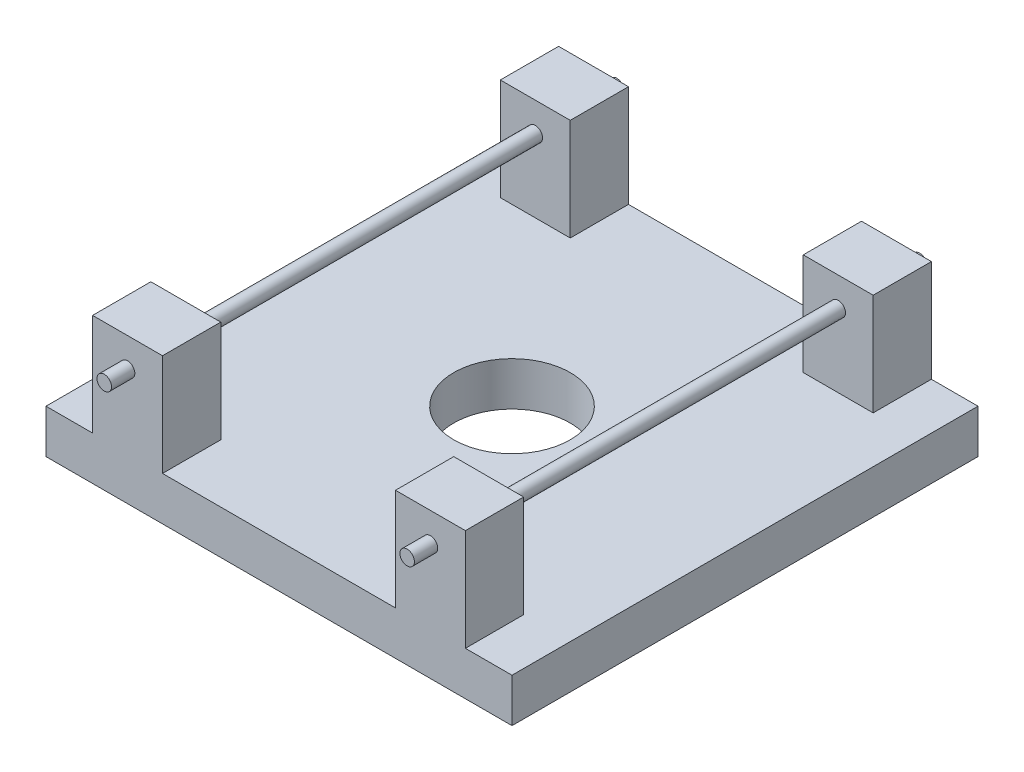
ISO-10303-21;
HEADER;
FILE_DESCRIPTION(('STEP AP214'),'2;1');
FILE_NAME('part.step','',(''),(''),'','','');
FILE_SCHEMA(('AUTOMOTIVE_DESIGN { 1 0 10303 214 1 1 1 1 }'));
ENDSEC;
DATA;
#1=APPLICATION_CONTEXT('core data for automotive mechanical design processes');
#2=APPLICATION_PROTOCOL_DEFINITION('international standard','automotive_design',2000,#1);
#3=PRODUCT_CONTEXT('',#1,'mechanical');
#4=PRODUCT('Part','Part','',(#3));
#5=PRODUCT_RELATED_PRODUCT_CATEGORY('part','',(#4));
#6=PRODUCT_DEFINITION_FORMATION('','',#4);
#7=PRODUCT_DEFINITION_CONTEXT('part definition',#1,'design');
#8=PRODUCT_DEFINITION('design','',#6,#7);
#9=PRODUCT_DEFINITION_SHAPE('','',#8);
#10=(LENGTH_UNIT() NAMED_UNIT(*) SI_UNIT(.MILLI.,.METRE.));
#11=(NAMED_UNIT(*) PLANE_ANGLE_UNIT() SI_UNIT($,.RADIAN.));
#12=(NAMED_UNIT(*) SI_UNIT($,.STERADIAN.) SOLID_ANGLE_UNIT());
#13=UNCERTAINTY_MEASURE_WITH_UNIT(LENGTH_MEASURE(1.E-05),#10,'distance_accuracy_value','');
#14=(GEOMETRIC_REPRESENTATION_CONTEXT(3) GLOBAL_UNCERTAINTY_ASSIGNED_CONTEXT((#13)) GLOBAL_UNIT_ASSIGNED_CONTEXT((#10,
#11,#12)) REPRESENTATION_CONTEXT('',''));
#15=CARTESIAN_POINT('',(0.,0.,0.));
#16=DIRECTION('',(0.,0.,1.));
#17=DIRECTION('',(1.,0.,0.));
#18=AXIS2_PLACEMENT_3D('',#15,#16,#17);
#19=CARTESIAN_POINT('',(-20.32,15.875,-25.4));
#20=DIRECTION('',(1.,0.,0.));
#21=DIRECTION('',(0.,0.,-1.));
#22=AXIS2_PLACEMENT_3D('',#19,#20,#21);
#23=PLANE('',#22);
#24=DIRECTION('',(0.,1.,0.));
#25=VECTOR('',#24,1.);
#26=CARTESIAN_POINT('',(-20.32,-34.092028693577,-19.05));
#27=LINE('',#26,#25);
#28=CARTESIAN_POINT('',(-20.32,4.7625,-19.05));
#29=VERTEX_POINT('',#28);
#30=CARTESIAN_POINT('',(-20.32,15.875,-19.05));
#31=VERTEX_POINT('',#30);
#32=EDGE_CURVE('E332',#29,#31,#27,.T.);
#33=ORIENTED_EDGE('',*,*,#32,.T.);
#34=DIRECTION('',(0.,0.,1.));
#35=VECTOR('',#34,1.);
#36=CARTESIAN_POINT('',(-20.32,15.875,-25.4));
#37=LINE('',#36,#35);
#38=CARTESIAN_POINT('',(-20.32,15.875,-25.4));
#39=VERTEX_POINT('',#38);
#40=EDGE_CURVE('E219',#39,#31,#37,.T.);
#41=ORIENTED_EDGE('',*,*,#40,.F.);
#42=DIRECTION('',(0.,-1.,0.));
#43=VECTOR('',#42,1.);
#44=CARTESIAN_POINT('',(-20.32,15.875,-25.4));
#45=LINE('',#44,#43);
#46=CARTESIAN_POINT('',(-20.32,4.7625,-25.4));
#47=VERTEX_POINT('',#46);
#48=EDGE_CURVE('E231',#39,#47,#45,.T.);
#49=ORIENTED_EDGE('',*,*,#48,.T.);
#50=DIRECTION('',(0.,0.,1.));
#51=VECTOR('',#50,1.);
#52=CARTESIAN_POINT('',(-20.32,4.7625,-25.4));
#53=LINE('',#52,#51);
#54=EDGE_CURVE('E232',#47,#29,#53,.T.);
#55=ORIENTED_EDGE('',*,*,#54,.T.);
#56=EDGE_LOOP('',(#33,#41,#49,#55));
#57=FACE_BOUND('',#56,.T.);
#58=ADVANCED_FACE('F33',(#57),#23,.F.);
#59=CARTESIAN_POINT('',(-12.7,15.875,-25.4));
#60=DIRECTION('',(-1.,0.,0.));
#61=DIRECTION('',(0.,0.,1.));
#62=AXIS2_PLACEMENT_3D('',#59,#60,#61);
#63=PLANE('',#62);
#64=DIRECTION('',(0.,1.,0.));
#65=VECTOR('',#64,1.);
#66=CARTESIAN_POINT('',(-12.7,-34.092028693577,-19.05));
#67=LINE('',#66,#65);
#68=CARTESIAN_POINT('',(-12.7,4.7625,-19.05));
#69=VERTEX_POINT('',#68);
#70=CARTESIAN_POINT('',(-12.7,15.875,-19.05));
#71=VERTEX_POINT('',#70);
#72=EDGE_CURVE('E330',#69,#71,#67,.T.);
#73=ORIENTED_EDGE('',*,*,#72,.F.);
#74=DIRECTION('',(0.,0.,-1.));
#75=VECTOR('',#74,1.);
#76=CARTESIAN_POINT('',(-12.7,4.7625,-25.4));
#77=LINE('',#76,#75);
#78=CARTESIAN_POINT('',(-12.7,4.7625,-25.4));
#79=VERTEX_POINT('',#78);
#80=EDGE_CURVE('E235',#69,#79,#77,.T.);
#81=ORIENTED_EDGE('',*,*,#80,.T.);
#82=DIRECTION('',(0.,-1.,0.));
#83=VECTOR('',#82,1.);
#84=CARTESIAN_POINT('',(-12.7,15.875,-25.4));
#85=LINE('',#84,#83);
#86=CARTESIAN_POINT('',(-12.7,15.875,-25.4));
#87=VERTEX_POINT('',#86);
#88=EDGE_CURVE('E241',#87,#79,#85,.T.);
#89=ORIENTED_EDGE('',*,*,#88,.F.);
#90=DIRECTION('',(0.,0.,-1.));
#91=VECTOR('',#90,1.);
#92=CARTESIAN_POINT('',(-12.7,15.875,-25.4));
#93=LINE('',#92,#91);
#94=EDGE_CURVE('E225',#71,#87,#93,.T.);
#95=ORIENTED_EDGE('',*,*,#94,.F.);
#96=EDGE_LOOP('',(#73,#81,#89,#95));
#97=FACE_BOUND('',#96,.T.);
#98=ADVANCED_FACE('F385',(#97),#63,.F.);
#99=CARTESIAN_POINT('',(0.,15.875,0.));
#100=DIRECTION('',(0.,1.,0.));
#101=DIRECTION('',(0.,0.,1.));
#102=AXIS2_PLACEMENT_3D('',#99,#100,#101);
#103=PLANE('',#102);
#104=ORIENTED_EDGE('',*,*,#40,.T.);
#105=DIRECTION('',(1.,0.,0.));
#106=VECTOR('',#105,1.);
#107=CARTESIAN_POINT('',(-20.32,15.875,-19.05));
#108=LINE('',#107,#106);
#109=EDGE_CURVE('E329',#31,#71,#108,.T.);
#110=ORIENTED_EDGE('',*,*,#109,.T.);
#111=ORIENTED_EDGE('',*,*,#94,.T.);
#112=DIRECTION('',(-1.,0.,0.));
#113=VECTOR('',#112,1.);
#114=CARTESIAN_POINT('',(-20.32,15.875,-25.4));
#115=LINE('',#114,#113);
#116=EDGE_CURVE('E229',#87,#39,#115,.T.);
#117=ORIENTED_EDGE('',*,*,#116,.T.);
#118=EDGE_LOOP('',(#104,#110,#111,#117));
#119=FACE_BOUND('',#118,.T.);
#120=ADVANCED_FACE('F389',(#119),#103,.T.);
#121=CARTESIAN_POINT('',(20.32,15.875,-25.4));
#122=DIRECTION('',(-1.,0.,0.));
#123=DIRECTION('',(0.,0.,1.));
#124=AXIS2_PLACEMENT_3D('',#121,#122,#123);
#125=PLANE('',#124);
#126=DIRECTION('',(0.,1.,0.));
#127=VECTOR('',#126,1.);
#128=CARTESIAN_POINT('',(20.32,-34.092028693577,19.05));
#129=LINE('',#128,#127);
#130=CARTESIAN_POINT('',(20.32,4.7625,19.05));
#131=VERTEX_POINT('',#130);
#132=CARTESIAN_POINT('',(20.32,15.875,19.05));
#133=VERTEX_POINT('',#132);
#134=EDGE_CURVE('E317',#131,#133,#129,.T.);
#135=ORIENTED_EDGE('',*,*,#134,.T.);
#136=DIRECTION('',(0.,0.,-1.));
#137=VECTOR('',#136,1.);
#138=CARTESIAN_POINT('',(20.32,15.875,-25.4));
#139=LINE('',#138,#137);
#140=CARTESIAN_POINT('',(20.32,15.875,25.4));
#141=VERTEX_POINT('',#140);
#142=EDGE_CURVE('E342',#141,#133,#139,.T.);
#143=ORIENTED_EDGE('',*,*,#142,.F.);
#144=DIRECTION('',(0.,-1.,0.));
#145=VECTOR('',#144,1.);
#146=CARTESIAN_POINT('',(20.32,15.875,25.4));
#147=LINE('',#146,#145);
#148=CARTESIAN_POINT('',(20.32,4.7625,25.4));
#149=VERTEX_POINT('',#148);
#150=EDGE_CURVE('E196',#141,#149,#147,.T.);
#151=ORIENTED_EDGE('',*,*,#150,.T.);
#152=DIRECTION('',(0.,0.,-1.));
#153=VECTOR('',#152,1.);
#154=CARTESIAN_POINT('',(20.32,4.7625,-25.4));
#155=LINE('',#154,#153);
#156=EDGE_CURVE('E201',#149,#131,#155,.T.);
#157=ORIENTED_EDGE('',*,*,#156,.T.);
#158=EDGE_LOOP('',(#135,#143,#151,#157));
#159=FACE_BOUND('',#158,.T.);
#160=ADVANCED_FACE('F433',(#159),#125,.F.);
#161=CARTESIAN_POINT('',(12.7,15.875,-25.4));
#162=DIRECTION('',(1.,0.,0.));
#163=DIRECTION('',(0.,0.,-1.));
#164=AXIS2_PLACEMENT_3D('',#161,#162,#163);
#165=PLANE('',#164);
#166=DIRECTION('',(0.,1.,0.));
#167=VECTOR('',#166,1.);
#168=CARTESIAN_POINT('',(12.7,-34.092028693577,19.05));
#169=LINE('',#168,#167);
#170=CARTESIAN_POINT('',(12.7,4.7625,19.05));
#171=VERTEX_POINT('',#170);
#172=CARTESIAN_POINT('',(12.7,15.875,19.05));
#173=VERTEX_POINT('',#172);
#174=EDGE_CURVE('E187',#171,#173,#169,.T.);
#175=ORIENTED_EDGE('',*,*,#174,.F.);
#176=DIRECTION('',(0.,0.,1.));
#177=VECTOR('',#176,1.);
#178=CARTESIAN_POINT('',(12.7,4.7625,-25.4));
#179=LINE('',#178,#177);
#180=CARTESIAN_POINT('',(12.7,4.7625,25.4));
#181=VERTEX_POINT('',#180);
#182=EDGE_CURVE('E204',#171,#181,#179,.T.);
#183=ORIENTED_EDGE('',*,*,#182,.T.);
#184=DIRECTION('',(0.,-1.,0.));
#185=VECTOR('',#184,1.);
#186=CARTESIAN_POINT('',(12.7,15.875,25.4));
#187=LINE('',#186,#185);
#188=CARTESIAN_POINT('',(12.7,15.875,25.4));
#189=VERTEX_POINT('',#188);
#190=EDGE_CURVE('E210',#189,#181,#187,.T.);
#191=ORIENTED_EDGE('',*,*,#190,.F.);
#192=DIRECTION('',(0.,0.,1.));
#193=VECTOR('',#192,1.);
#194=CARTESIAN_POINT('',(12.7,15.875,-25.4));
#195=LINE('',#194,#193);
#196=EDGE_CURVE('E194',#173,#189,#195,.T.);
#197=ORIENTED_EDGE('',*,*,#196,.F.);
#198=EDGE_LOOP('',(#175,#183,#191,#197));
#199=FACE_BOUND('',#198,.T.);
#200=ADVANCED_FACE('F426',(#199),#165,.F.);
#201=CARTESIAN_POINT('',(0.,15.875,0.));
#202=DIRECTION('',(0.,-1.,0.));
#203=DIRECTION('',(0.,0.,-1.));
#204=AXIS2_PLACEMENT_3D('',#201,#202,#203);
#205=PLANE('',#204);
#206=DIRECTION('',(-1.,0.,0.));
#207=VECTOR('',#206,1.);
#208=CARTESIAN_POINT('',(0.,15.875,19.05));
#209=LINE('',#208,#207);
#210=EDGE_CURVE('E177',#133,#173,#209,.T.);
#211=ORIENTED_EDGE('',*,*,#210,.T.);
#212=ORIENTED_EDGE('',*,*,#196,.T.);
#213=DIRECTION('',(1.,0.,0.));
#214=VECTOR('',#213,1.);
#215=CARTESIAN_POINT('',(20.32,15.875,25.4));
#216=LINE('',#215,#214);
#217=EDGE_CURVE('E193',#189,#141,#216,.T.);
#218=ORIENTED_EDGE('',*,*,#217,.T.);
#219=ORIENTED_EDGE('',*,*,#142,.T.);
#220=EDGE_LOOP('',(#211,#212,#218,#219));
#221=FACE_BOUND('',#220,.T.);
#222=ADVANCED_FACE('F430',(#221),#205,.F.);
#223=CARTESIAN_POINT('',(0.,4.7625,0.));
#224=DIRECTION('',(0.,1.,0.));
#225=DIRECTION('',(0.,0.,1.));
#226=AXIS2_PLACEMENT_3D('',#223,#224,#225);
#227=PLANE('',#226);
#228=ORIENTED_EDGE('',*,*,#54,.F.);
#229=DIRECTION('',(-1.,0.,0.));
#230=VECTOR('',#229,1.);
#231=CARTESIAN_POINT('',(-25.4,4.7625,-25.4));
#232=LINE('',#231,#230);
#233=CARTESIAN_POINT('',(-25.4,4.7625,-25.4));
#234=VERTEX_POINT('',#233);
#235=EDGE_CURVE('E260',#47,#234,#232,.T.);
#236=ORIENTED_EDGE('',*,*,#235,.T.);
#237=DIRECTION('',(0.,0.,1.));
#238=VECTOR('',#237,1.);
#239=CARTESIAN_POINT('',(-25.4,4.7625,-25.4));
#240=LINE('',#239,#238);
#241=CARTESIAN_POINT('',(-25.4,4.7625,25.4));
#242=VERTEX_POINT('',#241);
#243=EDGE_CURVE('E265',#234,#242,#240,.T.);
#244=ORIENTED_EDGE('',*,*,#243,.T.);
#245=DIRECTION('',(1.,0.,0.));
#246=VECTOR('',#245,1.);
#247=CARTESIAN_POINT('',(-25.4,4.7625,25.4));
#248=LINE('',#247,#246);
#249=CARTESIAN_POINT('',(-20.32,4.7625,25.4));
#250=VERTEX_POINT('',#249);
#251=EDGE_CURVE('E269',#242,#250,#248,.T.);
#252=ORIENTED_EDGE('',*,*,#251,.T.);
#253=CARTESIAN_POINT('',(-20.32,4.7625,19.05));
#254=VERTEX_POINT('',#253);
#255=EDGE_CURVE('E218',#254,#250,#53,.T.);
#256=ORIENTED_EDGE('',*,*,#255,.F.);
#257=DIRECTION('',(-1.,0.,0.));
#258=VECTOR('',#257,1.);
#259=CARTESIAN_POINT('',(-20.32,4.7625,19.05));
#260=LINE('',#259,#258);
#261=CARTESIAN_POINT('',(-12.7,4.7625,19.05));
#262=VERTEX_POINT('',#261);
#263=EDGE_CURVE('E314',#262,#254,#260,.T.);
#264=ORIENTED_EDGE('',*,*,#263,.F.);
#265=CARTESIAN_POINT('',(-12.7,4.7625,25.4));
#266=VERTEX_POINT('',#265);
#267=EDGE_CURVE('E236',#266,#262,#77,.T.);
#268=ORIENTED_EDGE('',*,*,#267,.F.);
#269=EDGE_CURVE('E273',#266,#181,#248,.T.);
#270=ORIENTED_EDGE('',*,*,#269,.T.);
#271=ORIENTED_EDGE('',*,*,#182,.F.);
#272=DIRECTION('',(1.,0.,0.));
#273=VECTOR('',#272,1.);
#274=CARTESIAN_POINT('',(0.,4.7625,19.05));
#275=LINE('',#274,#273);
#276=EDGE_CURVE('E315',#171,#131,#275,.T.);
#277=ORIENTED_EDGE('',*,*,#276,.T.);
#278=ORIENTED_EDGE('',*,*,#156,.F.);
#279=CARTESIAN_POINT('',(25.4,4.7625,25.4));
#280=VERTEX_POINT('',#279);
#281=EDGE_CURVE('E268',#149,#280,#248,.T.);
#282=ORIENTED_EDGE('',*,*,#281,.T.);
#283=DIRECTION('',(0.,0.,-1.));
#284=VECTOR('',#283,1.);
#285=CARTESIAN_POINT('',(25.4,4.7625,-25.4));
#286=LINE('',#285,#284);
#287=CARTESIAN_POINT('',(25.4,4.7625,-25.4));
#288=VERTEX_POINT('',#287);
#289=EDGE_CURVE('E257',#280,#288,#286,.T.);
#290=ORIENTED_EDGE('',*,*,#289,.T.);
#291=CARTESIAN_POINT('',(20.32,4.7625,-25.4));
#292=VERTEX_POINT('',#291);
#293=EDGE_CURVE('E262',#288,#292,#232,.T.);
#294=ORIENTED_EDGE('',*,*,#293,.T.);
#295=CARTESIAN_POINT('',(20.32,4.7625,-19.05));
#296=VERTEX_POINT('',#295);
#297=EDGE_CURVE('E205',#296,#292,#155,.T.);
#298=ORIENTED_EDGE('',*,*,#297,.F.);
#299=DIRECTION('',(1.,0.,0.));
#300=VECTOR('',#299,1.);
#301=CARTESIAN_POINT('',(0.,4.7625,-19.05));
#302=LINE('',#301,#300);
#303=CARTESIAN_POINT('',(12.7,4.7625,-19.05));
#304=VERTEX_POINT('',#303);
#305=EDGE_CURVE('E316',#304,#296,#302,.T.);
#306=ORIENTED_EDGE('',*,*,#305,.F.);
#307=CARTESIAN_POINT('',(12.7,4.7625,-25.4));
#308=VERTEX_POINT('',#307);
#309=EDGE_CURVE('E186',#308,#304,#179,.T.);
#310=ORIENTED_EDGE('',*,*,#309,.F.);
#311=EDGE_CURVE('E266',#308,#79,#232,.T.);
#312=ORIENTED_EDGE('',*,*,#311,.T.);
#313=ORIENTED_EDGE('',*,*,#80,.F.);
#314=DIRECTION('',(-1.,0.,0.));
#315=VECTOR('',#314,1.);
#316=CARTESIAN_POINT('',(-20.32,4.7625,-19.05));
#317=LINE('',#316,#315);
#318=EDGE_CURVE('E336',#69,#29,#317,.T.);
#319=ORIENTED_EDGE('',*,*,#318,.T.);
#320=EDGE_LOOP('',(#228,#236,#244,#252,#256,#264,#268,#270,#271,#277,#278,#282,#290,#294,#298,
#306,#310,#312,#313,#319));
#321=FACE_BOUND('',#320,.T.);
#322=CARTESIAN_POINT('',(0.,4.7625,0.));
#323=DIRECTION('',(0.,1.,0.));
#324=DIRECTION('',(0.,0.,1.));
#325=AXIS2_PLACEMENT_3D('',#322,#323,#324);
#326=CIRCLE('',#325,6.35);
#327=CARTESIAN_POINT('',(0.,4.7625,6.35));
#328=VERTEX_POINT('',#327);
#329=EDGE_CURVE('E250',#328,#328,#326,.T.);
#330=ORIENTED_EDGE('',*,*,#329,.F.);
#331=EDGE_LOOP('',(#330));
#332=FACE_BOUND('',#331,.T.);
#333=ADVANCED_FACE('F354',(#321,#332),#227,.T.);
#334=CARTESIAN_POINT('',(25.4,4.7625,-25.4));
#335=DIRECTION('',(-1.,0.,0.));
#336=DIRECTION('',(0.,0.,1.));
#337=AXIS2_PLACEMENT_3D('',#334,#335,#336);
#338=PLANE('',#337);
#339=DIRECTION('',(0.,0.,-1.));
#340=VECTOR('',#339,1.);
#341=CARTESIAN_POINT('',(25.4,0.,-25.4));
#342=LINE('',#341,#340);
#343=CARTESIAN_POINT('',(25.4,0.,25.4));
#344=VERTEX_POINT('',#343);
#345=CARTESIAN_POINT('',(25.4,0.,-25.4));
#346=VERTEX_POINT('',#345);
#347=EDGE_CURVE('E254',#344,#346,#342,.T.);
#348=ORIENTED_EDGE('',*,*,#347,.T.);
#349=DIRECTION('',(0.,-1.,0.));
#350=VECTOR('',#349,1.);
#351=CARTESIAN_POINT('',(25.4,4.7625,-25.4));
#352=LINE('',#351,#350);
#353=EDGE_CURVE('E289',#288,#346,#352,.T.);
#354=ORIENTED_EDGE('',*,*,#353,.F.);
#355=ORIENTED_EDGE('',*,*,#289,.F.);
#356=DIRECTION('',(0.,-1.,0.));
#357=VECTOR('',#356,1.);
#358=CARTESIAN_POINT('',(25.4,4.7625,25.4));
#359=LINE('',#358,#357);
#360=EDGE_CURVE('E272',#280,#344,#359,.T.);
#361=ORIENTED_EDGE('',*,*,#360,.T.);
#362=EDGE_LOOP('',(#348,#354,#355,#361));
#363=FACE_BOUND('',#362,.T.);
#364=ADVANCED_FACE('F35',(#363),#338,.F.);
#365=CARTESIAN_POINT('',(-25.4,4.7625,-25.4));
#366=DIRECTION('',(0.,0.,1.));
#367=DIRECTION('',(1.,0.,0.));
#368=AXIS2_PLACEMENT_3D('',#365,#366,#367);
#369=PLANE('',#368);
#370=CARTESIAN_POINT('',(16.51,12.7,-25.4));
#371=DIRECTION('',(0.,0.,1.));
#372=DIRECTION('',(1.,0.,0.));
#373=AXIS2_PLACEMENT_3D('',#370,#371,#372);
#374=CIRCLE('',#373,0.793749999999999);
#375=CARTESIAN_POINT('',(17.30375,12.7,-25.4));
#376=VERTEX_POINT('',#375);
#377=EDGE_CURVE('E306',#376,#376,#374,.T.);
#378=ORIENTED_EDGE('',*,*,#377,.T.);
#379=EDGE_LOOP('',(#378));
#380=FACE_BOUND('',#379,.T.);
#381=CARTESIAN_POINT('',(-16.51,12.7,-25.4));
#382=DIRECTION('',(0.,0.,1.));
#383=DIRECTION('',(1.,0.,0.));
#384=AXIS2_PLACEMENT_3D('',#381,#382,#383);
#385=CIRCLE('',#384,0.793749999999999);
#386=CARTESIAN_POINT('',(-15.71625,12.7,-25.4));
#387=VERTEX_POINT('',#386);
#388=EDGE_CURVE('E298',#387,#387,#385,.T.);
#389=ORIENTED_EDGE('',*,*,#388,.T.);
#390=EDGE_LOOP('',(#389));
#391=FACE_BOUND('',#390,.T.);
#392=DIRECTION('',(-1.,0.,0.));
#393=VECTOR('',#392,1.);
#394=CARTESIAN_POINT('',(-25.4,0.,-25.4));
#395=LINE('',#394,#393);
#396=CARTESIAN_POINT('',(-25.4,0.,-25.4));
#397=VERTEX_POINT('',#396);
#398=EDGE_CURVE('E276',#346,#397,#395,.T.);
#399=ORIENTED_EDGE('',*,*,#398,.T.);
#400=DIRECTION('',(0.,-1.,0.));
#401=VECTOR('',#400,1.);
#402=CARTESIAN_POINT('',(-25.4,4.7625,-25.4));
#403=LINE('',#402,#401);
#404=EDGE_CURVE('E286',#234,#397,#403,.T.);
#405=ORIENTED_EDGE('',*,*,#404,.F.);
#406=ORIENTED_EDGE('',*,*,#235,.F.);
#407=ORIENTED_EDGE('',*,*,#48,.F.);
#408=ORIENTED_EDGE('',*,*,#116,.F.);
#409=ORIENTED_EDGE('',*,*,#88,.T.);
#410=ORIENTED_EDGE('',*,*,#311,.F.);
#411=DIRECTION('',(0.,-1.,0.));
#412=VECTOR('',#411,1.);
#413=CARTESIAN_POINT('',(12.7,15.875,-25.4));
#414=LINE('',#413,#412);
#415=CARTESIAN_POINT('',(12.7,15.875,-25.4));
#416=VERTEX_POINT('',#415);
#417=EDGE_CURVE('E213',#416,#308,#414,.T.);
#418=ORIENTED_EDGE('',*,*,#417,.F.);
#419=DIRECTION('',(-1.,0.,0.));
#420=VECTOR('',#419,1.);
#421=CARTESIAN_POINT('',(20.32,15.875,-25.4));
#422=LINE('',#421,#420);
#423=CARTESIAN_POINT('',(20.32,15.875,-25.4));
#424=VERTEX_POINT('',#423);
#425=EDGE_CURVE('E191',#424,#416,#422,.T.);
#426=ORIENTED_EDGE('',*,*,#425,.F.);
#427=DIRECTION('',(0.,-1.,0.));
#428=VECTOR('',#427,1.);
#429=CARTESIAN_POINT('',(20.32,15.875,-25.4));
#430=LINE('',#429,#428);
#431=EDGE_CURVE('E215',#424,#292,#430,.T.);
#432=ORIENTED_EDGE('',*,*,#431,.T.);
#433=ORIENTED_EDGE('',*,*,#293,.F.);
#434=ORIENTED_EDGE('',*,*,#353,.T.);
#435=EDGE_LOOP('',(#399,#405,#406,#407,#408,#409,#410,#418,#426,#432,#433,#434));
#436=FACE_BOUND('',#435,.T.);
#437=ADVANCED_FACE('F349',(#380,#391,#436),#369,.F.);
#438=CARTESIAN_POINT('',(-25.4,4.7625,-25.4));
#439=DIRECTION('',(1.,0.,0.));
#440=DIRECTION('',(0.,0.,-1.));
#441=AXIS2_PLACEMENT_3D('',#438,#439,#440);
#442=PLANE('',#441);
#443=DIRECTION('',(0.,0.,1.));
#444=VECTOR('',#443,1.);
#445=CARTESIAN_POINT('',(-25.4,0.,-25.4));
#446=LINE('',#445,#444);
#447=CARTESIAN_POINT('',(-25.4,0.,25.4));
#448=VERTEX_POINT('',#447);
#449=EDGE_CURVE('E278',#397,#448,#446,.T.);
#450=ORIENTED_EDGE('',*,*,#449,.T.);
#451=DIRECTION('',(0.,-1.,0.));
#452=VECTOR('',#451,1.);
#453=CARTESIAN_POINT('',(-25.4,4.7625,25.4));
#454=LINE('',#453,#452);
#455=EDGE_CURVE('E283',#242,#448,#454,.T.);
#456=ORIENTED_EDGE('',*,*,#455,.F.);
#457=ORIENTED_EDGE('',*,*,#243,.F.);
#458=ORIENTED_EDGE('',*,*,#404,.T.);
#459=EDGE_LOOP('',(#450,#456,#457,#458));
#460=FACE_BOUND('',#459,.T.);
#461=ADVANCED_FACE('F368',(#460),#442,.F.);
#462=CARTESIAN_POINT('',(-25.4,4.7625,25.4));
#463=DIRECTION('',(0.,0.,-1.));
#464=DIRECTION('',(-1.,0.,0.));
#465=AXIS2_PLACEMENT_3D('',#462,#463,#464);
#466=PLANE('',#465);
#467=CARTESIAN_POINT('',(16.51,12.7,25.4));
#468=DIRECTION('',(0.,0.,-1.));
#469=DIRECTION('',(-1.,0.,0.));
#470=AXIS2_PLACEMENT_3D('',#467,#468,#469);
#471=CIRCLE('',#470,0.793749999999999);
#472=CARTESIAN_POINT('',(15.71625,12.7,25.4));
#473=VERTEX_POINT('',#472);
#474=EDGE_CURVE('E700',#473,#473,#471,.T.);
#475=ORIENTED_EDGE('',*,*,#474,.T.);
#476=EDGE_LOOP('',(#475));
#477=FACE_BOUND('',#476,.T.);
#478=CARTESIAN_POINT('',(-16.51,12.7,25.4));
#479=DIRECTION('',(0.,0.,-1.));
#480=DIRECTION('',(-1.,0.,0.));
#481=AXIS2_PLACEMENT_3D('',#478,#479,#480);
#482=CIRCLE('',#481,0.793749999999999);
#483=CARTESIAN_POINT('',(-17.30375,12.7,25.4));
#484=VERTEX_POINT('',#483);
#485=EDGE_CURVE('E293',#484,#484,#482,.T.);
#486=ORIENTED_EDGE('',*,*,#485,.T.);
#487=EDGE_LOOP('',(#486));
#488=FACE_BOUND('',#487,.T.);
#489=DIRECTION('',(1.,0.,0.));
#490=VECTOR('',#489,1.);
#491=CARTESIAN_POINT('',(-25.4,0.,25.4));
#492=LINE('',#491,#490);
#493=EDGE_CURVE('E261',#448,#344,#492,.T.);
#494=ORIENTED_EDGE('',*,*,#493,.T.);
#495=ORIENTED_EDGE('',*,*,#360,.F.);
#496=ORIENTED_EDGE('',*,*,#281,.F.);
#497=ORIENTED_EDGE('',*,*,#150,.F.);
#498=ORIENTED_EDGE('',*,*,#217,.F.);
#499=ORIENTED_EDGE('',*,*,#190,.T.);
#500=ORIENTED_EDGE('',*,*,#269,.F.);
#501=DIRECTION('',(0.,-1.,0.));
#502=VECTOR('',#501,1.);
#503=CARTESIAN_POINT('',(-12.7,15.875,25.4));
#504=LINE('',#503,#502);
#505=CARTESIAN_POINT('',(-12.7,15.875,25.4));
#506=VERTEX_POINT('',#505);
#507=EDGE_CURVE('E244',#506,#266,#504,.T.);
#508=ORIENTED_EDGE('',*,*,#507,.F.);
#509=DIRECTION('',(1.,0.,0.));
#510=VECTOR('',#509,1.);
#511=CARTESIAN_POINT('',(-20.32,15.875,25.4));
#512=LINE('',#511,#510);
#513=CARTESIAN_POINT('',(-20.32,15.875,25.4));
#514=VERTEX_POINT('',#513);
#515=EDGE_CURVE('E222',#514,#506,#512,.T.);
#516=ORIENTED_EDGE('',*,*,#515,.F.);
#517=DIRECTION('',(0.,-1.,0.));
#518=VECTOR('',#517,1.);
#519=CARTESIAN_POINT('',(-20.32,15.875,25.4));
#520=LINE('',#519,#518);
#521=EDGE_CURVE('E247',#514,#250,#520,.T.);
#522=ORIENTED_EDGE('',*,*,#521,.T.);
#523=ORIENTED_EDGE('',*,*,#251,.F.);
#524=ORIENTED_EDGE('',*,*,#455,.T.);
#525=EDGE_LOOP('',(#494,#495,#496,#497,#498,#499,#500,#508,#516,#522,#523,#524));
#526=FACE_BOUND('',#525,.T.);
#527=ADVANCED_FACE('F372',(#477,#488,#526),#466,.F.);
#528=CARTESIAN_POINT('',(0.,0.,0.));
#529=DIRECTION('',(0.,1.,0.));
#530=DIRECTION('',(0.,0.,1.));
#531=AXIS2_PLACEMENT_3D('',#528,#529,#530);
#532=PLANE('',#531);
#533=CARTESIAN_POINT('',(0.,0.,0.));
#534=DIRECTION('',(0.,1.,0.));
#535=DIRECTION('',(0.,0.,1.));
#536=AXIS2_PLACEMENT_3D('',#533,#534,#535);
#537=CIRCLE('',#536,6.35);
#538=CARTESIAN_POINT('',(0.,0.,6.35));
#539=VERTEX_POINT('',#538);
#540=EDGE_CURVE('E251',#539,#539,#537,.T.);
#541=ORIENTED_EDGE('',*,*,#540,.T.);
#542=EDGE_LOOP('',(#541));
#543=FACE_BOUND('',#542,.T.);
#544=ORIENTED_EDGE('',*,*,#347,.F.);
#545=ORIENTED_EDGE('',*,*,#493,.F.);
#546=ORIENTED_EDGE('',*,*,#449,.F.);
#547=ORIENTED_EDGE('',*,*,#398,.F.);
#548=EDGE_LOOP('',(#544,#545,#546,#547));
#549=FACE_BOUND('',#548,.T.);
#550=ADVANCED_FACE('F364',(#543,#549),#532,.F.);
#551=CARTESIAN_POINT('',(0.,0.,0.));
#552=DIRECTION('',(0.,1.,0.));
#553=DIRECTION('',(0.,0.,1.));
#554=AXIS2_PLACEMENT_3D('',#551,#552,#553);
#555=CYLINDRICAL_SURFACE('',#554,6.35);
#556=CARTESIAN_POINT('',(0.,0.,6.35));
#557=CARTESIAN_POINT('',(0.,0.049609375,6.35));
#558=CARTESIAN_POINT('',(0.,0.09921875,6.35));
#559=CARTESIAN_POINT('',(0.,0.1984375,6.35));
#560=CARTESIAN_POINT('',(0.,0.248046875,6.35));
#561=CARTESIAN_POINT('',(0.,0.347265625,6.35));
#562=CARTESIAN_POINT('',(0.,0.396875,6.35));
#563=CARTESIAN_POINT('',(0.,0.49609375,6.35));
#564=CARTESIAN_POINT('',(0.,0.545703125,6.35));
#565=CARTESIAN_POINT('',(0.,0.644921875,6.35));
#566=CARTESIAN_POINT('',(0.,0.69453125,6.35));
#567=CARTESIAN_POINT('',(0.,0.79375,6.35));
#568=CARTESIAN_POINT('',(0.,0.843359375,6.35));
#569=CARTESIAN_POINT('',(0.,0.942578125,6.35));
#570=CARTESIAN_POINT('',(0.,0.9921875,6.35));
#571=CARTESIAN_POINT('',(0.,1.09140625,6.35));
#572=CARTESIAN_POINT('',(0.,1.141015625,6.35));
#573=CARTESIAN_POINT('',(0.,1.240234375,6.35));
#574=CARTESIAN_POINT('',(0.,1.28984375,6.35));
#575=CARTESIAN_POINT('',(0.,1.3890625,6.35));
#576=CARTESIAN_POINT('',(0.,1.438671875,6.35));
#577=CARTESIAN_POINT('',(0.,1.537890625,6.35));
#578=CARTESIAN_POINT('',(0.,1.5875,6.35));
#579=CARTESIAN_POINT('',(0.,1.68671875,6.35));
#580=CARTESIAN_POINT('',(0.,1.736328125,6.35));
#581=CARTESIAN_POINT('',(0.,1.835546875,6.35));
#582=CARTESIAN_POINT('',(0.,1.88515625,6.35));
#583=CARTESIAN_POINT('',(0.,1.984375,6.35));
#584=CARTESIAN_POINT('',(0.,2.033984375,6.35));
#585=CARTESIAN_POINT('',(0.,2.133203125,6.35));
#586=CARTESIAN_POINT('',(0.,2.1828125,6.35));
#587=CARTESIAN_POINT('',(0.,2.28203125,6.35));
#588=CARTESIAN_POINT('',(0.,2.331640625,6.35));
#589=CARTESIAN_POINT('',(0.,2.430859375,6.35));
#590=CARTESIAN_POINT('',(0.,2.48046875,6.35));
#591=CARTESIAN_POINT('',(0.,2.5796875,6.35));
#592=CARTESIAN_POINT('',(0.,2.629296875,6.35));
#593=CARTESIAN_POINT('',(0.,2.728515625,6.35));
#594=CARTESIAN_POINT('',(0.,2.778125,6.35));
#595=CARTESIAN_POINT('',(0.,2.87734375,6.35));
#596=CARTESIAN_POINT('',(0.,2.926953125,6.35));
#597=CARTESIAN_POINT('',(0.,3.026171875,6.35));
#598=CARTESIAN_POINT('',(0.,3.07578125,6.35));
#599=CARTESIAN_POINT('',(0.,3.175,6.35));
#600=CARTESIAN_POINT('',(0.,3.224609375,6.35));
#601=CARTESIAN_POINT('',(0.,3.323828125,6.35));
#602=CARTESIAN_POINT('',(0.,3.3734375,6.35));
#603=CARTESIAN_POINT('',(0.,3.47265625,6.35));
#604=CARTESIAN_POINT('',(0.,3.522265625,6.35));
#605=CARTESIAN_POINT('',(0.,3.621484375,6.35));
#606=CARTESIAN_POINT('',(0.,3.67109375,6.35));
#607=CARTESIAN_POINT('',(0.,3.7703125,6.35));
#608=CARTESIAN_POINT('',(0.,3.819921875,6.35));
#609=CARTESIAN_POINT('',(0.,3.919140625,6.35));
#610=CARTESIAN_POINT('',(0.,3.96875,6.35));
#611=CARTESIAN_POINT('',(0.,4.06796875,6.35));
#612=CARTESIAN_POINT('',(0.,4.117578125,6.35));
#613=CARTESIAN_POINT('',(0.,4.216796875,6.35));
#614=CARTESIAN_POINT('',(0.,4.26640625,6.35));
#615=CARTESIAN_POINT('',(0.,4.365625,6.35));
#616=CARTESIAN_POINT('',(0.,4.415234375,6.35));
#617=CARTESIAN_POINT('',(0.,4.514453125,6.35));
#618=CARTESIAN_POINT('',(0.,4.5640625,6.35));
#619=CARTESIAN_POINT('',(0.,4.66328125,6.35));
#620=CARTESIAN_POINT('',(0.,4.712890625,6.35));
#621=CARTESIAN_POINT('',(0.,4.7625,6.35));
#622=B_SPLINE_CURVE_WITH_KNOTS('',3,(#556,#557,#558,#559,#560,#561,#562,#563,#564,#565,#566,
#567,#568,#569,#570,#571,#572,#573,#574,#575,#576,#577,#578,#579,#580,#581,#582,#583,#584,#585,
#586,#587,#588,#589,#590,#591,#592,#593,#594,#595,#596,#597,#598,#599,#600,#601,#602,#603,#604,
#605,#606,#607,#608,#609,#610,#611,#612,#613,#614,#615,#616,#617,#618,#619,#620,#621),
.UNSPECIFIED.,.F.,.F.,(4,2,2,2,2,2,2,2,2,2,2,2,2,2,2,2,2,2,2,2,2,2,2,2,2,2,2,2,2,2,2,2,4),(0.,
0.148828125,0.29765625,0.446484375,0.5953125,0.744140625,0.89296875,1.041796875,1.190625,
1.339453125,1.48828125,1.637109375,1.7859375,1.934765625,2.08359375,2.232421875,2.38125,
2.530078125,2.67890625,2.827734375,2.9765625,3.125390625,3.27421875,3.423046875,3.571875,
3.720703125,3.86953125,4.018359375,4.1671875,4.316015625,4.46484375,4.613671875,4.7625),.UNSPECIFIED.);
#623=EDGE_CURVE('BSEAM402',#539,#328,#622,.T.);
#624=ORIENTED_EDGE('',*,*,#540,.F.);
#625=ORIENTED_EDGE('',*,*,#329,.T.);
#626=ORIENTED_EDGE('',*,*,#623,.T.);
#627=ORIENTED_EDGE('',*,*,#623,.F.);
#628=EDGE_LOOP('',(#624,#626,#625,#627));
#629=FACE_BOUND('',#628,.T.);
#630=ADVANCED_FACE('F402',(#629),#555,.F.);
#631=CARTESIAN_POINT('',(-20.32,15.875,19.05));
#632=VERTEX_POINT('',#631);
#633=EDGE_CURVE('E223',#632,#514,#37,.T.);
#634=ORIENTED_EDGE('',*,*,#633,.F.);
#635=DIRECTION('',(0.,1.,0.));
#636=VECTOR('',#635,1.);
#637=CARTESIAN_POINT('',(-20.32,-34.092028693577,19.05));
#638=LINE('',#637,#636);
#639=EDGE_CURVE('E50',#254,#632,#638,.T.);
#640=ORIENTED_EDGE('',*,*,#639,.F.);
#641=ORIENTED_EDGE('',*,*,#255,.T.);
#642=ORIENTED_EDGE('',*,*,#521,.F.);
#643=EDGE_LOOP('',(#634,#640,#641,#642));
#644=FACE_BOUND('',#643,.T.);
#645=ADVANCED_FACE('F394',(#644),#23,.F.);
#646=ORIENTED_EDGE('',*,*,#267,.T.);
#647=DIRECTION('',(0.,1.,0.));
#648=VECTOR('',#647,1.);
#649=CARTESIAN_POINT('',(-12.7,-34.092028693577,19.05));
#650=LINE('',#649,#648);
#651=CARTESIAN_POINT('',(-12.7,15.875,19.05));
#652=VERTEX_POINT('',#651);
#653=EDGE_CURVE('E326',#262,#652,#650,.T.);
#654=ORIENTED_EDGE('',*,*,#653,.T.);
#655=EDGE_CURVE('E226',#506,#652,#93,.T.);
#656=ORIENTED_EDGE('',*,*,#655,.F.);
#657=ORIENTED_EDGE('',*,*,#507,.T.);
#658=EDGE_LOOP('',(#646,#654,#656,#657));
#659=FACE_BOUND('',#658,.T.);
#660=ADVANCED_FACE('F399',(#659),#63,.F.);
#661=DIRECTION('',(1.,0.,0.));
#662=VECTOR('',#661,1.);
#663=CARTESIAN_POINT('',(-20.32,15.875,19.05));
#664=LINE('',#663,#662);
#665=EDGE_CURVE('E178',#632,#652,#664,.T.);
#666=ORIENTED_EDGE('',*,*,#665,.F.);
#667=ORIENTED_EDGE('',*,*,#633,.T.);
#668=ORIENTED_EDGE('',*,*,#515,.T.);
#669=ORIENTED_EDGE('',*,*,#655,.T.);
#670=EDGE_LOOP('',(#666,#667,#668,#669));
#671=FACE_BOUND('',#670,.T.);
#672=ADVANCED_FACE('F408',(#671),#103,.T.);
#673=CARTESIAN_POINT('',(20.32,15.875,-19.05));
#674=VERTEX_POINT('',#673);
#675=EDGE_CURVE('E207',#674,#424,#139,.T.);
#676=ORIENTED_EDGE('',*,*,#675,.F.);
#677=DIRECTION('',(0.,1.,0.));
#678=VECTOR('',#677,1.);
#679=CARTESIAN_POINT('',(20.32,-34.092028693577,-19.05));
#680=LINE('',#679,#678);
#681=EDGE_CURVE('E58',#296,#674,#680,.T.);
#682=ORIENTED_EDGE('',*,*,#681,.F.);
#683=ORIENTED_EDGE('',*,*,#297,.T.);
#684=ORIENTED_EDGE('',*,*,#431,.F.);
#685=EDGE_LOOP('',(#676,#682,#683,#684));
#686=FACE_BOUND('',#685,.T.);
#687=ADVANCED_FACE('F351',(#686),#125,.F.);
#688=ORIENTED_EDGE('',*,*,#309,.T.);
#689=DIRECTION('',(0.,1.,0.));
#690=VECTOR('',#689,1.);
#691=CARTESIAN_POINT('',(12.7,-34.092028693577,-19.05));
#692=LINE('',#691,#690);
#693=CARTESIAN_POINT('',(12.7,15.875,-19.05));
#694=VERTEX_POINT('',#693);
#695=EDGE_CURVE('E172',#304,#694,#692,.T.);
#696=ORIENTED_EDGE('',*,*,#695,.T.);
#697=EDGE_CURVE('E185',#416,#694,#195,.T.);
#698=ORIENTED_EDGE('',*,*,#697,.F.);
#699=ORIENTED_EDGE('',*,*,#417,.T.);
#700=EDGE_LOOP('',(#688,#696,#698,#699));
#701=FACE_BOUND('',#700,.T.);
#702=ADVANCED_FACE('F183',(#701),#165,.F.);
#703=ORIENTED_EDGE('',*,*,#697,.T.);
#704=DIRECTION('',(-1.,0.,0.));
#705=VECTOR('',#704,1.);
#706=CARTESIAN_POINT('',(0.,15.875,-19.05));
#707=LINE('',#706,#705);
#708=EDGE_CURVE('E169',#674,#694,#707,.T.);
#709=ORIENTED_EDGE('',*,*,#708,.F.);
#710=ORIENTED_EDGE('',*,*,#675,.T.);
#711=ORIENTED_EDGE('',*,*,#425,.T.);
#712=EDGE_LOOP('',(#703,#709,#710,#711));
#713=FACE_BOUND('',#712,.T.);
#714=ADVANCED_FACE('F189',(#713),#205,.F.);
#715=CARTESIAN_POINT('',(0.,-34.092028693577,19.05));
#716=DIRECTION('',(0.,0.,-1.));
#717=DIRECTION('',(-1.,0.,0.));
#718=AXIS2_PLACEMENT_3D('',#715,#716,#717);
#719=PLANE('',#718);
#720=CARTESIAN_POINT('',(16.51,12.7,19.05));
#721=DIRECTION('',(0.,0.,-1.));
#722=DIRECTION('',(-1.,0.,0.));
#723=AXIS2_PLACEMENT_3D('',#720,#721,#722);
#724=CIRCLE('',#723,0.793749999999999);
#725=CARTESIAN_POINT('',(15.71625,12.7,19.05));
#726=VERTEX_POINT('',#725);
#727=EDGE_CURVE('E11',#726,#726,#724,.T.);
#728=ORIENTED_EDGE('',*,*,#727,.F.);
#729=EDGE_LOOP('',(#728));
#730=FACE_BOUND('',#729,.T.);
#731=ORIENTED_EDGE('',*,*,#174,.T.);
#732=ORIENTED_EDGE('',*,*,#210,.F.);
#733=ORIENTED_EDGE('',*,*,#134,.F.);
#734=ORIENTED_EDGE('',*,*,#276,.F.);
#735=EDGE_LOOP('',(#731,#732,#733,#734));
#736=FACE_BOUND('',#735,.T.);
#737=ADVANCED_FACE('F428',(#730,#736),#719,.T.);
#738=CARTESIAN_POINT('',(0.,-34.092028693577,-19.05));
#739=DIRECTION('',(0.,0.,-1.));
#740=DIRECTION('',(-1.,0.,0.));
#741=AXIS2_PLACEMENT_3D('',#738,#739,#740);
#742=PLANE('',#741);
#743=CARTESIAN_POINT('',(16.51,12.7,-19.05));
#744=DIRECTION('',(0.,0.,-1.));
#745=DIRECTION('',(-1.,0.,0.));
#746=AXIS2_PLACEMENT_3D('',#743,#744,#745);
#747=CIRCLE('',#746,0.793749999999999);
#748=CARTESIAN_POINT('',(15.71625,12.7,-19.05));
#749=VERTEX_POINT('',#748);
#750=EDGE_CURVE('E37',#749,#749,#747,.T.);
#751=ORIENTED_EDGE('',*,*,#750,.T.);
#752=EDGE_LOOP('',(#751));
#753=FACE_BOUND('',#752,.T.);
#754=ORIENTED_EDGE('',*,*,#305,.T.);
#755=ORIENTED_EDGE('',*,*,#681,.T.);
#756=ORIENTED_EDGE('',*,*,#708,.T.);
#757=ORIENTED_EDGE('',*,*,#695,.F.);
#758=EDGE_LOOP('',(#754,#755,#756,#757));
#759=FACE_BOUND('',#758,.T.);
#760=ADVANCED_FACE('F171',(#753,#759),#742,.F.);
#761=CARTESIAN_POINT('',(-20.32,-34.092028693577,-19.05));
#762=DIRECTION('',(0.,0.,1.));
#763=DIRECTION('',(1.,0.,0.));
#764=AXIS2_PLACEMENT_3D('',#761,#762,#763);
#765=PLANE('',#764);
#766=CARTESIAN_POINT('',(-16.51,12.7,-19.05));
#767=DIRECTION('',(0.,0.,1.));
#768=DIRECTION('',(1.,0.,0.));
#769=AXIS2_PLACEMENT_3D('',#766,#767,#768);
#770=CIRCLE('',#769,0.793749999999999);
#771=CARTESIAN_POINT('',(-15.71625,12.7,-19.05));
#772=VERTEX_POINT('',#771);
#773=EDGE_CURVE('E42',#772,#772,#770,.T.);
#774=ORIENTED_EDGE('',*,*,#773,.F.);
#775=EDGE_LOOP('',(#774));
#776=FACE_BOUND('',#775,.T.);
#777=ORIENTED_EDGE('',*,*,#72,.T.);
#778=ORIENTED_EDGE('',*,*,#109,.F.);
#779=ORIENTED_EDGE('',*,*,#32,.F.);
#780=ORIENTED_EDGE('',*,*,#318,.F.);
#781=EDGE_LOOP('',(#777,#778,#779,#780));
#782=FACE_BOUND('',#781,.T.);
#783=ADVANCED_FACE('F387',(#776,#782),#765,.T.);
#784=CARTESIAN_POINT('',(-20.32,-34.092028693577,19.05));
#785=DIRECTION('',(0.,0.,1.));
#786=DIRECTION('',(1.,0.,0.));
#787=AXIS2_PLACEMENT_3D('',#784,#785,#786);
#788=PLANE('',#787);
#789=CARTESIAN_POINT('',(-16.51,12.7,19.05));
#790=DIRECTION('',(0.,0.,1.));
#791=DIRECTION('',(1.,0.,0.));
#792=AXIS2_PLACEMENT_3D('',#789,#790,#791);
#793=CIRCLE('',#792,0.793749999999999);
#794=CARTESIAN_POINT('',(-15.71625,12.7,19.05));
#795=VERTEX_POINT('',#794);
#796=EDGE_CURVE('E291',#795,#795,#793,.T.);
#797=ORIENTED_EDGE('',*,*,#796,.T.);
#798=EDGE_LOOP('',(#797));
#799=FACE_BOUND('',#798,.T.);
#800=ORIENTED_EDGE('',*,*,#263,.T.);
#801=ORIENTED_EDGE('',*,*,#639,.T.);
#802=ORIENTED_EDGE('',*,*,#665,.T.);
#803=ORIENTED_EDGE('',*,*,#653,.F.);
#804=EDGE_LOOP('',(#800,#801,#802,#803));
#805=FACE_BOUND('',#804,.T.);
#806=ADVANCED_FACE('F418',(#799,#805),#788,.F.);
#807=CARTESIAN_POINT('',(-16.51,12.7,-27.94));
#808=DIRECTION('',(0.,0.,1.));
#809=DIRECTION('',(1.,0.,0.));
#810=AXIS2_PLACEMENT_3D('',#807,#808,#809);
#811=CYLINDRICAL_SURFACE('',#810,0.793749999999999);
#812=ORIENTED_EDGE('',*,*,#773,.T.);
#813=EDGE_LOOP('',(#812));
#814=FACE_BOUND('',#813,.T.);
#815=ORIENTED_EDGE('',*,*,#796,.F.);
#816=EDGE_LOOP('',(#815));
#817=FACE_BOUND('',#816,.T.);
#818=ADVANCED_FACE('F583',(#814,#817),#811,.T.);
#819=CARTESIAN_POINT('',(-16.51,12.7,27.94));
#820=DIRECTION('',(0.,0.,1.));
#821=DIRECTION('',(1.,0.,0.));
#822=AXIS2_PLACEMENT_3D('',#819,#820,#821);
#823=PLANE('',#822);
#824=CARTESIAN_POINT('',(-16.51,12.7,27.94));
#825=DIRECTION('',(0.,0.,1.));
#826=DIRECTION('',(1.,0.,0.));
#827=AXIS2_PLACEMENT_3D('',#824,#825,#826);
#828=CIRCLE('',#827,0.793749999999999);
#829=CARTESIAN_POINT('',(-15.71625,12.7,27.94));
#830=VERTEX_POINT('',#829);
#831=EDGE_CURVE('E301',#830,#830,#828,.T.);
#832=ORIENTED_EDGE('',*,*,#831,.T.);
#833=EDGE_LOOP('',(#832));
#834=FACE_BOUND('',#833,.T.);
#835=ADVANCED_FACE('F591',(#834),#823,.T.);
#836=ORIENTED_EDGE('',*,*,#831,.F.);
#837=EDGE_LOOP('',(#836));
#838=FACE_BOUND('',#837,.T.);
#839=ORIENTED_EDGE('',*,*,#485,.F.);
#840=EDGE_LOOP('',(#839));
#841=FACE_BOUND('',#840,.T.);
#842=ADVANCED_FACE('F595',(#838,#841),#811,.T.);
#843=CARTESIAN_POINT('',(-16.51,12.7,-27.94));
#844=DIRECTION('',(0.,0.,1.));
#845=DIRECTION('',(1.,0.,0.));
#846=AXIS2_PLACEMENT_3D('',#843,#844,#845);
#847=CIRCLE('',#846,0.793749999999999);
#848=CARTESIAN_POINT('',(-15.71625,12.7,-27.94));
#849=VERTEX_POINT('',#848);
#850=EDGE_CURVE('E294',#849,#849,#847,.T.);
#851=ORIENTED_EDGE('',*,*,#850,.T.);
#852=EDGE_LOOP('',(#851));
#853=FACE_BOUND('',#852,.T.);
#854=ORIENTED_EDGE('',*,*,#388,.F.);
#855=EDGE_LOOP('',(#854));
#856=FACE_BOUND('',#855,.T.);
#857=ADVANCED_FACE('F594',(#853,#856),#811,.T.);
#858=CARTESIAN_POINT('',(-16.51,12.7,-27.94));
#859=DIRECTION('',(0.,0.,1.));
#860=DIRECTION('',(1.,0.,0.));
#861=AXIS2_PLACEMENT_3D('',#858,#859,#860);
#862=PLANE('',#861);
#863=ORIENTED_EDGE('',*,*,#850,.F.);
#864=EDGE_LOOP('',(#863));
#865=FACE_BOUND('',#864,.T.);
#866=ADVANCED_FACE('F620',(#865),#862,.F.);
#867=CARTESIAN_POINT('',(16.51,12.7,-27.94));
#868=DIRECTION('',(0.,0.,1.));
#869=DIRECTION('',(1.,0.,0.));
#870=AXIS2_PLACEMENT_3D('',#867,#868,#869);
#871=CYLINDRICAL_SURFACE('',#870,0.793749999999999);
#872=ORIENTED_EDGE('',*,*,#727,.T.);
#873=EDGE_LOOP('',(#872));
#874=FACE_BOUND('',#873,.T.);
#875=ORIENTED_EDGE('',*,*,#750,.F.);
#876=EDGE_LOOP('',(#875));
#877=FACE_BOUND('',#876,.T.);
#878=ADVANCED_FACE('F628',(#874,#877),#871,.T.);
#879=CARTESIAN_POINT('',(16.51,12.7,27.94));
#880=DIRECTION('',(0.,0.,1.));
#881=DIRECTION('',(1.,0.,0.));
#882=AXIS2_PLACEMENT_3D('',#879,#880,#881);
#883=PLANE('',#882);
#884=CARTESIAN_POINT('',(16.51,12.7,27.94));
#885=DIRECTION('',(0.,0.,1.));
#886=DIRECTION('',(1.,0.,0.));
#887=AXIS2_PLACEMENT_3D('',#884,#885,#886);
#888=CIRCLE('',#887,0.793749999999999);
#889=CARTESIAN_POINT('',(17.30375,12.7,27.94));
#890=VERTEX_POINT('',#889);
#891=EDGE_CURVE('E697',#890,#890,#888,.T.);
#892=ORIENTED_EDGE('',*,*,#891,.T.);
#893=EDGE_LOOP('',(#892));
#894=FACE_BOUND('',#893,.T.);
#895=ADVANCED_FACE('F638',(#894),#883,.T.);
#896=ORIENTED_EDGE('',*,*,#891,.F.);
#897=EDGE_LOOP('',(#896));
#898=FACE_BOUND('',#897,.T.);
#899=ORIENTED_EDGE('',*,*,#474,.F.);
#900=EDGE_LOOP('',(#899));
#901=FACE_BOUND('',#900,.T.);
#902=ADVANCED_FACE('F642',(#898,#901),#871,.T.);
#903=CARTESIAN_POINT('',(16.51,12.7,-27.94));
#904=DIRECTION('',(0.,0.,1.));
#905=DIRECTION('',(1.,0.,0.));
#906=AXIS2_PLACEMENT_3D('',#903,#904,#905);
#907=CIRCLE('',#906,0.793749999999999);
#908=CARTESIAN_POINT('',(17.30375,12.7,-27.94));
#909=VERTEX_POINT('',#908);
#910=EDGE_CURVE('E696',#909,#909,#907,.T.);
#911=ORIENTED_EDGE('',*,*,#910,.T.);
#912=EDGE_LOOP('',(#911));
#913=FACE_BOUND('',#912,.T.);
#914=ORIENTED_EDGE('',*,*,#377,.F.);
#915=EDGE_LOOP('',(#914));
#916=FACE_BOUND('',#915,.T.);
#917=ADVANCED_FACE('F641',(#913,#916),#871,.T.);
#918=CARTESIAN_POINT('',(16.51,12.7,-27.94));
#919=DIRECTION('',(0.,0.,1.));
#920=DIRECTION('',(1.,0.,0.));
#921=AXIS2_PLACEMENT_3D('',#918,#919,#920);
#922=PLANE('',#921);
#923=ORIENTED_EDGE('',*,*,#910,.F.);
#924=EDGE_LOOP('',(#923));
#925=FACE_BOUND('',#924,.T.);
#926=ADVANCED_FACE('F667',(#925),#922,.F.);
#927=CLOSED_SHELL('',(#58,#98,#120,#160,#200,#222,#333,#364,#437,#461,#527,#550,#630,#645,#660,
#672,#687,#702,#714,#737,#760,#783,#806,#818,#835,#842,#857,#866,#878,#895,#902,#917,#926));
#928=MANIFOLD_SOLID_BREP('B2',#927);
#929=ADVANCED_BREP_SHAPE_REPRESENTATION('',(#18,#928),#14);
#930=SHAPE_DEFINITION_REPRESENTATION(#9,#929);
ENDSEC;
END-ISO-10303-21;
